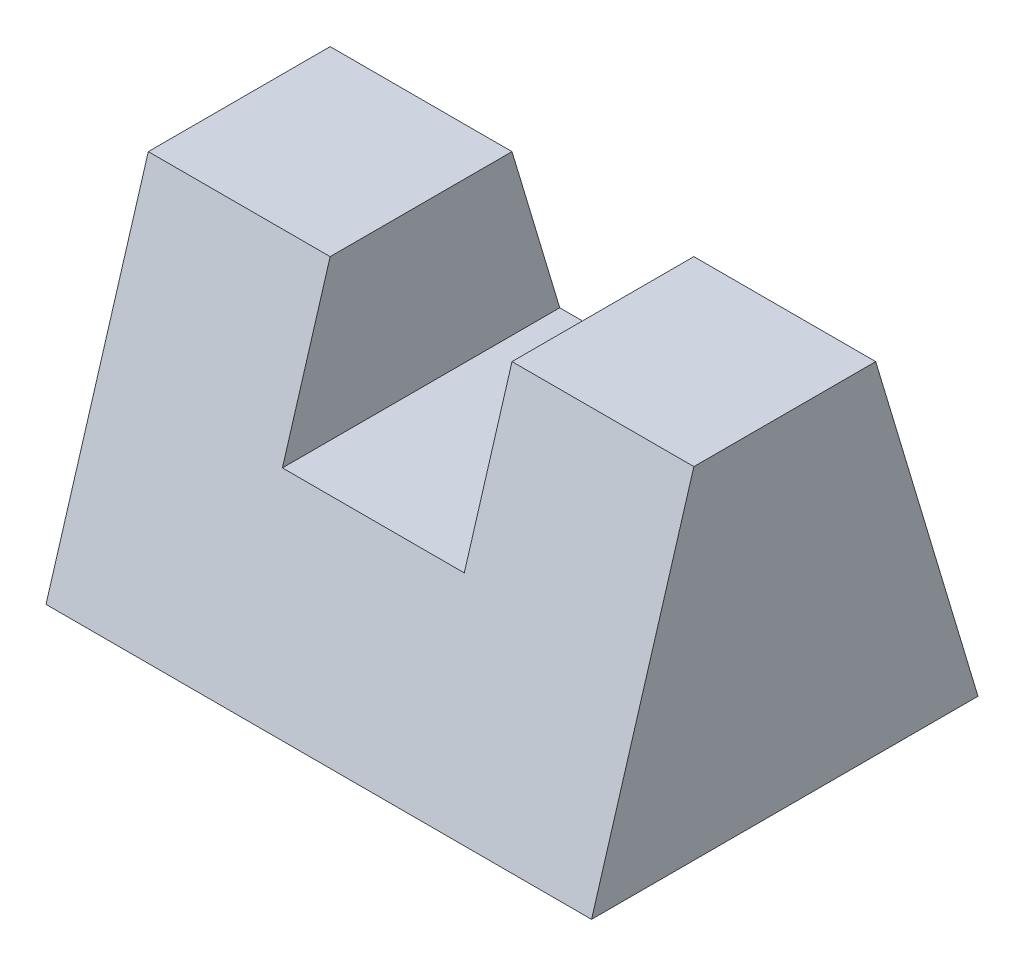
from build123d import *

# Parameters (mm, degrees)
EXTRUDE_1_DEPTH     = 120
SKETCH_2_W          = 40
SKETCH_2_H          = 76.819923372
CUT_EXTRUDE_1_DEPTH = 35


with BuildPart() as part:
    # Sketch 1 → Extrude 1 (new body)
    with BuildSketch(Plane(origin=(0, 0, 0), x_dir=(0, 0, -1), z_dir=(1, 0, 0))):
        Polygon((-42.5, 0), (42.5, 0), (20, 75), (-20, 75), align=None)
    extrude(amount=EXTRUDE_1_DEPTH)

    # Sketch 2 → Cut-Extrude 1 (cut)
    with BuildSketch(Plane(origin=(0, 75, 0), x_dir=(1, 0, 0), z_dir=(0, 1, 0))):
        with Locations((60, -1.436781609)):
            Rectangle(SKETCH_2_W, SKETCH_2_H)
    extrude(amount=-CUT_EXTRUDE_1_DEPTH, mode=Mode.SUBTRACT)


solid = part.part
